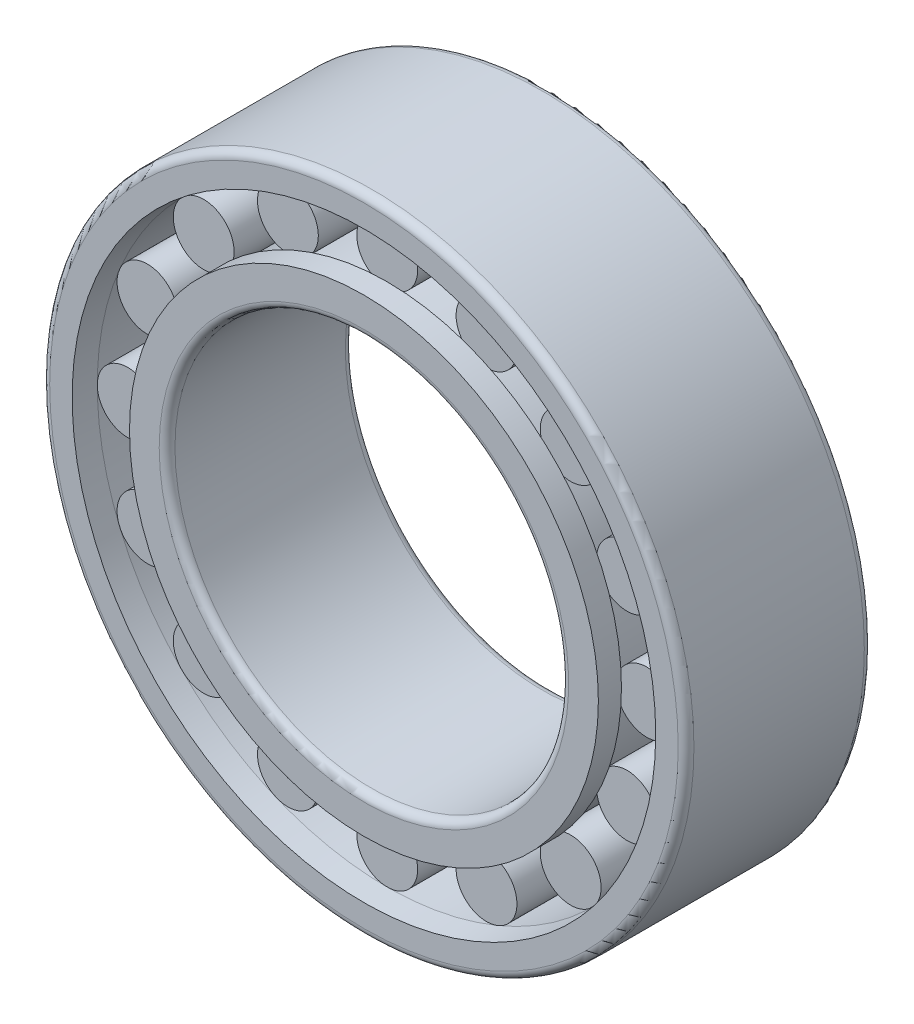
from build123d import *

# Parameters (mm, degrees)
BASESKE_W            = 8.45
BASESKE_H            = 4.25
FILLET1_R            = 1.1
CIRPATTERNBALL_COUNT = 16


with BuildPart() as part:
    # BaseSke → Roller (revolve)
    with BuildSketch(Plane(origin=(0, 0, 0), x_dir=(0, 0, -1), z_dir=(1, 0, 0)), mode=Mode.PRIVATE) as roller_sk:
        with Locations((-5.525, 38.375)):
            Rectangle(BASESKE_W, BASESKE_H)
        with Locations((5.525, 38.375)):
            Rectangle(BASESKE_W, BASESKE_H)
    roller = revolve(roller_sk.sketch.rotate(Axis((0, 36.25, 9.75), (0, 0, -1)), 90), axis=Axis((0, 36.25, 9.75), (0, 0, -1)))

    # OuterRaceSke → OuterRace (revolve)
    with BuildSketch(Plane(origin=(0, 0, 0), x_dir=(0, 0, -1), z_dir=(1, 0, 0)), mode=Mode.PRIVATE) as outerrace_sk:
        Polygon((-13, 45), (13, 45), (13, 40.76215094), (9.775, 40.48), (-9.775, 40.48), (-13, 40.76215094), align=None)
    revolve(outerrace_sk.sketch.rotate(Axis((0, 0, 50.391616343), (0, 0, -1)), 90), axis=Axis((0, 0, 50.391616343), (0, 0, -1)))

    # InnerRaceSke → InnerRace (revolve)
    with BuildSketch(Plane(origin=(0, 0, 0), x_dir=(0, 0, -1), z_dir=(1, 0, 0)), mode=Mode.PRIVATE) as innerrace_sk:
        Polygon((-13, 27.5), (13, 27.5), (13, 32.75), (9.775, 32.75), (9.775, 32.02), (-9.775, 32.02), (-9.775, 32.75), (-13, 32.75), align=None)
    revolve(innerrace_sk.sketch.rotate(Axis((0, 0, 70.862590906), (0, 0, -1)), 90), axis=Axis((0, 0, 70.862590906), (0, 0, -1)))

    # Fillet1
    fillet1_edges = [part.edges().sort_by_distance(p)[0] for p in [
        (-45, 0, 13),
        (-45, 0, -13),
        (-27.5, 0, -13),
        (-27.5, 0, 13),
    ]]
    fillet(fillet1_edges, radius=FILLET1_R)

    # CirPatternBall: Roller ×16 about axis
    cirpatternball_axis = Axis((0, 0, 0), (0, 0, 1))
    for i in range(1, CIRPATTERNBALL_COUNT):
        add(roller.rotate(cirpatternball_axis, i * 360 / CIRPATTERNBALL_COUNT))


solid = part.part
